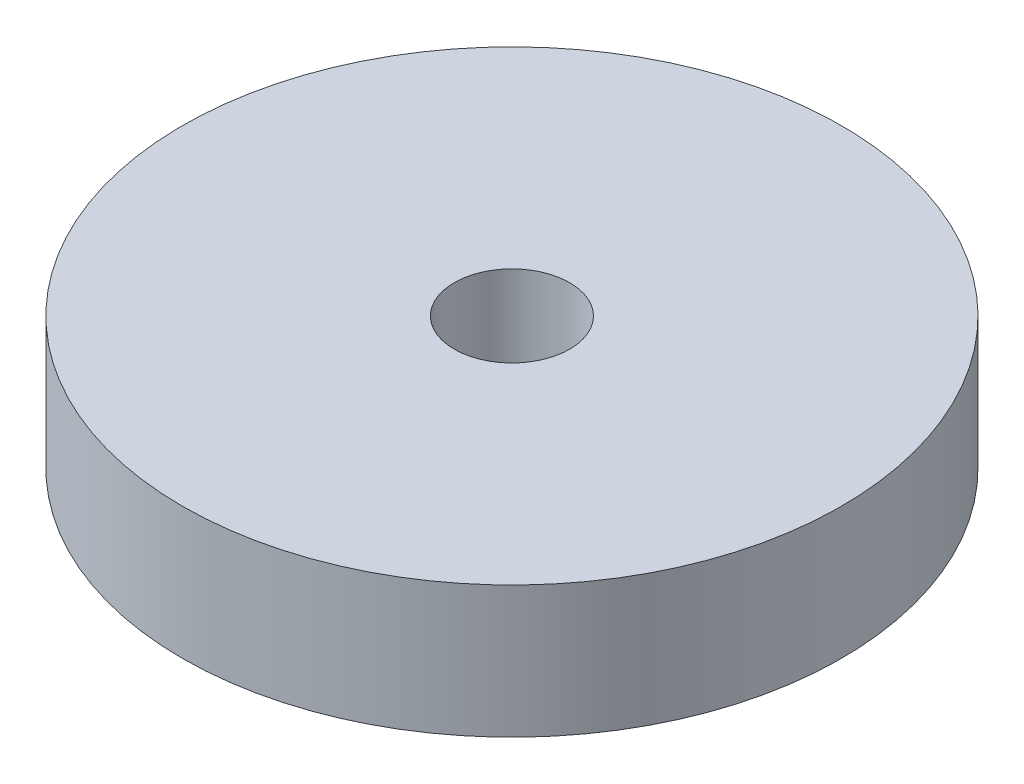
ISO-10303-21;
HEADER;
FILE_DESCRIPTION(('STEP AP214'),'2;1');
FILE_NAME('part.step','',(''),(''),'','','');
FILE_SCHEMA(('AUTOMOTIVE_DESIGN { 1 0 10303 214 1 1 1 1 }'));
ENDSEC;
DATA;
#1=APPLICATION_CONTEXT('core data for automotive mechanical design processes');
#2=APPLICATION_PROTOCOL_DEFINITION('international standard','automotive_design',2000,#1);
#3=PRODUCT_CONTEXT('',#1,'mechanical');
#4=PRODUCT('Part','Part','',(#3));
#5=PRODUCT_RELATED_PRODUCT_CATEGORY('part','',(#4));
#6=PRODUCT_DEFINITION_FORMATION('','',#4);
#7=PRODUCT_DEFINITION_CONTEXT('part definition',#1,'design');
#8=PRODUCT_DEFINITION('design','',#6,#7);
#9=PRODUCT_DEFINITION_SHAPE('','',#8);
#10=(LENGTH_UNIT() NAMED_UNIT(*) SI_UNIT(.MILLI.,.METRE.));
#11=(NAMED_UNIT(*) PLANE_ANGLE_UNIT() SI_UNIT($,.RADIAN.));
#12=(NAMED_UNIT(*) SI_UNIT($,.STERADIAN.) SOLID_ANGLE_UNIT());
#13=UNCERTAINTY_MEASURE_WITH_UNIT(LENGTH_MEASURE(1.E-05),#10,'distance_accuracy_value','');
#14=(GEOMETRIC_REPRESENTATION_CONTEXT(3) GLOBAL_UNCERTAINTY_ASSIGNED_CONTEXT((#13)) GLOBAL_UNIT_ASSIGNED_CONTEXT((#10,
#11,#12)) REPRESENTATION_CONTEXT('',''));
#15=CARTESIAN_POINT('',(0.,0.,0.));
#16=DIRECTION('',(0.,0.,1.));
#17=DIRECTION('',(1.,0.,0.));
#18=AXIS2_PLACEMENT_3D('',#15,#16,#17);
#19=CARTESIAN_POINT('',(0.,4.,0.));
#20=DIRECTION('',(0.,1.,0.));
#21=DIRECTION('',(0.,0.,1.));
#22=AXIS2_PLACEMENT_3D('',#19,#20,#21);
#23=PLANE('',#22);
#24=CARTESIAN_POINT('',(0.,4.,0.));
#25=DIRECTION('',(0.,1.,0.));
#26=DIRECTION('',(0.,0.,1.));
#27=AXIS2_PLACEMENT_3D('',#24,#25,#26);
#28=CIRCLE('',#27,10.);
#29=CARTESIAN_POINT('',(0.,4.,10.));
#30=VERTEX_POINT('',#29);
#31=EDGE_CURVE('E12',#30,#30,#28,.T.);
#32=ORIENTED_EDGE('',*,*,#31,.T.);
#33=EDGE_LOOP('',(#32));
#34=FACE_BOUND('',#33,.T.);
#35=CARTESIAN_POINT('',(0.,4.,0.));
#36=DIRECTION('',(0.,1.,0.));
#37=DIRECTION('',(0.,0.,1.));
#38=AXIS2_PLACEMENT_3D('',#35,#36,#37);
#39=CIRCLE('',#38,1.75);
#40=CARTESIAN_POINT('',(0.,4.,1.75));
#41=VERTEX_POINT('',#40);
#42=EDGE_CURVE('E51',#41,#41,#39,.T.);
#43=ORIENTED_EDGE('',*,*,#42,.F.);
#44=EDGE_LOOP('',(#43));
#45=FACE_BOUND('',#44,.T.);
#46=ADVANCED_FACE('F40',(#34,#45),#23,.T.);
#47=CARTESIAN_POINT('',(0.,0.,0.));
#48=DIRECTION('',(0.,1.,0.));
#49=DIRECTION('',(0.,0.,1.));
#50=AXIS2_PLACEMENT_3D('',#47,#48,#49);
#51=PLANE('',#50);
#52=CARTESIAN_POINT('',(0.,0.,0.));
#53=DIRECTION('',(0.,1.,0.));
#54=DIRECTION('',(0.,0.,1.));
#55=AXIS2_PLACEMENT_3D('',#52,#53,#54);
#56=CIRCLE('',#55,10.);
#57=CARTESIAN_POINT('',(0.,0.,10.));
#58=VERTEX_POINT('',#57);
#59=EDGE_CURVE('E47',#58,#58,#56,.T.);
#60=ORIENTED_EDGE('',*,*,#59,.F.);
#61=EDGE_LOOP('',(#60));
#62=FACE_BOUND('',#61,.T.);
#63=CARTESIAN_POINT('',(0.,0.,0.));
#64=DIRECTION('',(0.,1.,0.));
#65=DIRECTION('',(0.,0.,1.));
#66=AXIS2_PLACEMENT_3D('',#63,#64,#65);
#67=CIRCLE('',#66,1.75);
#68=CARTESIAN_POINT('',(0.,0.,1.75));
#69=VERTEX_POINT('',#68);
#70=EDGE_CURVE('E55',#69,#69,#67,.T.);
#71=ORIENTED_EDGE('',*,*,#70,.T.);
#72=EDGE_LOOP('',(#71));
#73=FACE_BOUND('',#72,.T.);
#74=ADVANCED_FACE('F61',(#62,#73),#51,.F.);
#75=CARTESIAN_POINT('',(0.,4.,0.));
#76=DIRECTION('',(0.,-1.,0.));
#77=DIRECTION('',(0.,0.,-1.));
#78=AXIS2_PLACEMENT_3D('',#75,#76,#77);
#79=CYLINDRICAL_SURFACE('',#78,10.);
#80=ORIENTED_EDGE('',*,*,#31,.F.);
#81=EDGE_LOOP('',(#80));
#82=FACE_BOUND('',#81,.T.);
#83=ORIENTED_EDGE('',*,*,#59,.T.);
#84=EDGE_LOOP('',(#83));
#85=FACE_BOUND('',#84,.T.);
#86=ADVANCED_FACE('F42',(#82,#85),#79,.T.);
#87=CARTESIAN_POINT('',(0.,4.,0.));
#88=DIRECTION('',(0.,-1.,0.));
#89=DIRECTION('',(0.,0.,-1.));
#90=AXIS2_PLACEMENT_3D('',#87,#88,#89);
#91=CYLINDRICAL_SURFACE('',#90,1.75);
#92=ORIENTED_EDGE('',*,*,#42,.T.);
#93=EDGE_LOOP('',(#92));
#94=FACE_BOUND('',#93,.T.);
#95=ORIENTED_EDGE('',*,*,#70,.F.);
#96=EDGE_LOOP('',(#95));
#97=FACE_BOUND('',#96,.T.);
#98=ADVANCED_FACE('F63',(#94,#97),#91,.F.);
#99=CLOSED_SHELL('',(#46,#74,#86,#98));
#100=MANIFOLD_SOLID_BREP('B2',#99);
#101=ADVANCED_BREP_SHAPE_REPRESENTATION('',(#18,#100),#14);
#102=SHAPE_DEFINITION_REPRESENTATION(#9,#101);
ENDSEC;
END-ISO-10303-21;
